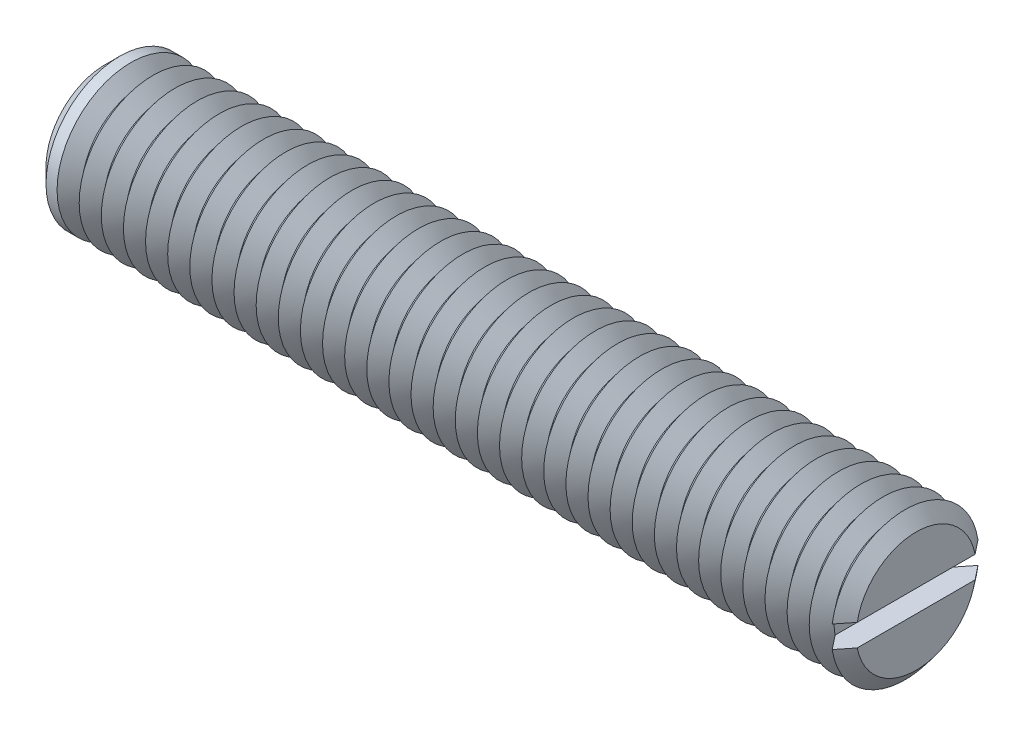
from build123d import *

# Parameters (mm, degrees)
SKETCH1_R       = 5
EXTRUDE1_DEPTH  = 27.5
SKETCH2_W       = 1.5
SKETCH2_H       = 1.5
EXTRUDE2_DEPTH  = 7.5
CHAMFER1_SIZE   = 1
LPATTERN1_COUNT = 36
LPATTERN1_PITCH = 1.5


with BuildPart() as part:
    # Sketch1 → Extrude1 (new, symmetric)
    with BuildSketch(Plane(origin=(0, 0, 0), x_dir=(0, 0, -1), z_dir=(1, 0, 0))):
        Circle(SKETCH1_R)
    extrude(amount=EXTRUDE1_DEPTH, both=True)

    # Sketch2 → Extrude2 (cut, symmetric)
    with BuildSketch(Plane.XY):
        with Locations((26.75, 0)):
            Rectangle(SKETCH2_W, SKETCH2_H)
    extrude(amount=EXTRUDE2_DEPTH, both=True, mode=Mode.SUBTRACT)

    # Chamfer1
    chamfer1_edges = [part.edges().sort_by_distance(p)[0] for p in [
        (-27.5, 0, 5),
    ]]
    chamfer(chamfer1_edges, length=CHAMFER1_SIZE)

    # Sketch3 → Cut-Revolve1 (revolve, cut)
    with BuildSketch(Plane.XY, mode=Mode.PRIVATE) as cut_revolve1_sk:
        Polygon((26.75, -5), (28.25, -5), (27.5, -4.0632503), align=None)
    cut_revolve1 = revolve(cut_revolve1_sk.sketch.rotate(Axis((0, 0, 0), (1, 0, 0)), 261.373073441), axis=Axis((0, 0, 0), (1, 0, 0)), mode=Mode.SUBTRACT)

    # LPattern1: Cut-Revolve1 ×36
    with Locations(*[(-i * LPATTERN1_PITCH, 0, 0) for i in range(1, LPATTERN1_COUNT)]):
        add(cut_revolve1, mode=Mode.SUBTRACT)


solid = part.part
